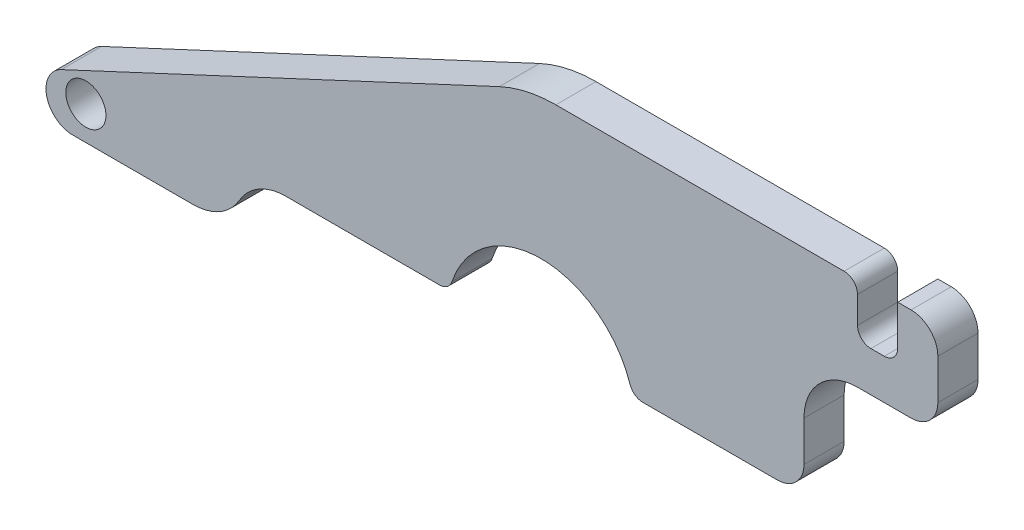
from build123d import *

# Parameters (mm, degrees)
SKETCH1_R           = 0.75
BOSS_EXTRUDE1_DEPTH = 1.5


with BuildPart() as part:
    # Sketch1 → Boss-Extrude1 (new body)
    with BuildSketch(Plane.XY):
        with BuildLine():
            Line((-25.911909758, 5.468807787), (-9.55954879, 13.094038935))
            ThreePointArc((-9.55954879, 13.094038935), (-8.528655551, 13.443980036), (-7.446457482, 13.5625))
            Line((-7.446457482, 13.5625), (3.320069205, 13.5625))
            ThreePointArc((3.320069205, 13.5625), (3.673622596, 13.416053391), (3.820069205, 13.0625))
            Line((3.820069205, 13.0625), (3.820069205, 12.0625))
            ThreePointArc((3.820069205, 12.0625), (3.966515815, 11.708946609), (4.320069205, 11.5625))
            Line((4.320069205, 11.5625), (4.820069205, 11.5625))
            ThreePointArc((4.820069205, 11.5625), (5.173622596, 11.708946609), (5.320069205, 12.0625))
            Line((5.320069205, 12.0625), (5.320069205, 13.5625))
            Line((5.320069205, 13.5625), (5.820069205, 13.5625))
            ThreePointArc((5.820069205, 13.5625), (6.527175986, 13.269606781), (6.820069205, 12.5625))
            Line((6.820069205, 12.5625), (6.820069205, 11.0625))
            ThreePointArc((6.820069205, 11.0625), (6.527175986, 10.355393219), (5.820069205, 10.0625))
            Line((5.820069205, 10.0625), (4.007569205, 10.0625))
            Line((4.007569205, 10.0625), (3.820069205, 10.0625))
            ThreePointArc((3.820069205, 10.0625), (2.405855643, 9.476713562), (1.820069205, 8.0625))
            Line((1.820069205, 8.0625), (1.820069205, 6.5625))
            ThreePointArc((1.820069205, 6.5625), (1.527175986, 5.855393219), (0.820069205, 5.5625))
            Line((0.820069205, 5.5625), (-4.200328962, 5.5625))
            ThreePointArc((-4.200328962, 5.5625), (-4.493479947, 5.657453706), (-4.675287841, 5.90625))
            ThreePointArc((-4.675287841, 5.90625), (-8, 8.3125), (-11.324712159, 5.90625))
            ThreePointArc((-11.324712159, 5.90625), (-11.506520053, 5.657453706), (-11.799671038, 5.5625))
            Line((-11.799671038, 5.5625), (-17.535898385, 5.5625))
            ThreePointArc((-17.535898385, 5.5625), (-18.535898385, 5.294550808), (-19.267949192, 4.5625))
            ThreePointArc((-19.267949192, 4.5625), (-20, 3.830449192), (-21, 3.5625))
            Line((-21, 3.5625), (-25.489291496, 3.5625))
            ThreePointArc((-25.489291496, 3.5625), (-26.465587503, 4.346060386), (-25.911909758, 5.468807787))
        make_face()
        with Locations((-25, 4.8125)):
            Circle(SKETCH1_R, mode=Mode.SUBTRACT)
    extrude(amount=BOSS_EXTRUDE1_DEPTH)


solid = part.part
